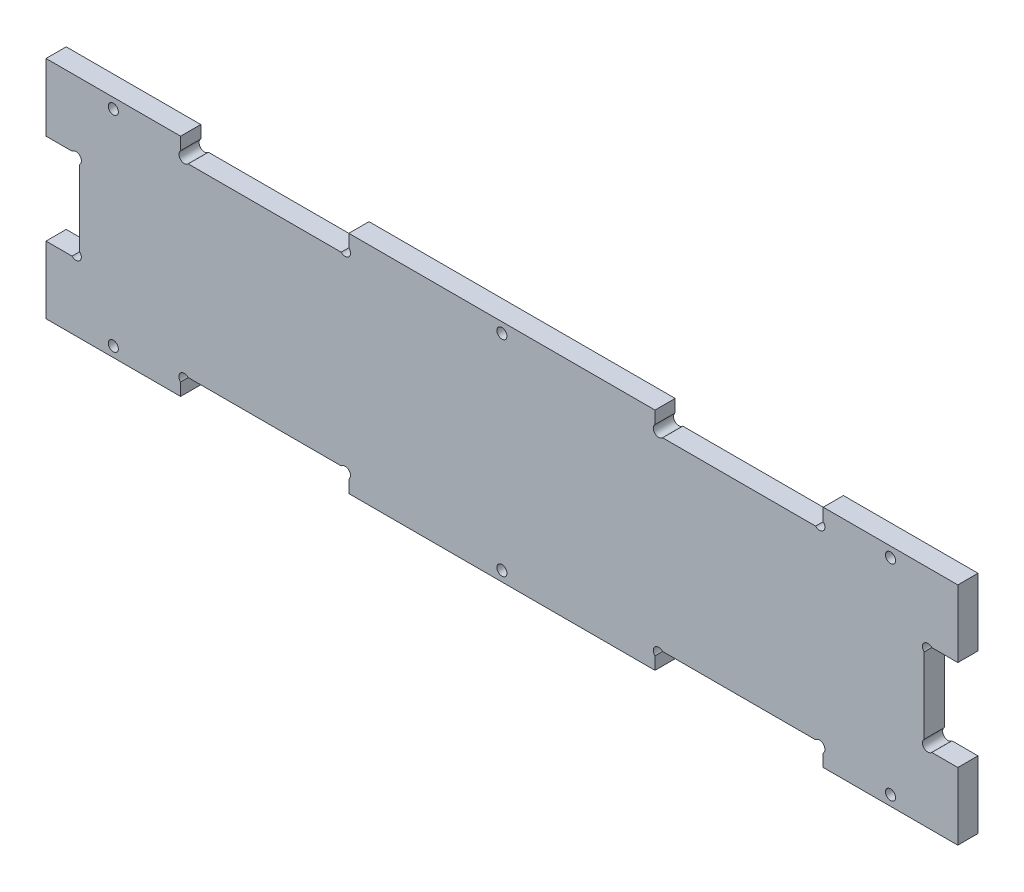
from build123d import *

# Parameters (mm, degrees)
ESQUISSE1_W             = 271
ESQUISSE1_H             = 55
BASE_EXTRUSION_DEPTH    = 6
ESQUISSE4_W             = 40
ESQUISSE4_H             = 6
ESQUISSE4_W_2           = 91
EXTRUSION1_DEPTH        = 6
ESQUISSE6_W             = 40
ESQUISSE6_H             = 6
ESQUISSE6_W_2           = 91
EXTRUSION2_DEPTH        = 6
ESQUISSE2_R             = 1.5
ENL_V_MAT_EXTRU_3_DEPTH = 6
ESQUISSE7_W             = 10
ESQUISSE7_H             = 27
ENL_V_MAT_EXTRU_4_DEPTH = 6
ESQUISSE5_R             = 1.6
ENL_V_MAT_EXTRU_2_DEPTH = 6


with BuildPart() as part:
    # Esquisse1 → Base-Extrusion (new body)
    with BuildSketch(Plane.XY):
        with Locations((85.838267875, 9.500100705)):
            Rectangle(ESQUISSE1_W, ESQUISSE1_H)
    extrude(amount=BASE_EXTRUSION_DEPTH)

    # Esquisse4 → Extrusion1 (add)
    with BuildSketch(Plane.XZ.offset(17.999899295)):
        with Locations((201.338267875, 3)):
            Rectangle(ESQUISSE4_W, ESQUISSE4_H)
        with Locations((-29.661732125, 3)):
            Rectangle(ESQUISSE4_W, ESQUISSE4_H)
        with Locations((85.838267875, 3)):
            Rectangle(ESQUISSE4_W_2, ESQUISSE4_H)
    extrude(amount=EXTRUSION1_DEPTH)

    # Esquisse6 → Extrusion2 (add)
    with BuildSketch(Plane(origin=(0, 37.000100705, 0), x_dir=(-1, 0, 0), z_dir=(0, 1, 0))):
        with Locations((29.661732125, 3)):
            Rectangle(ESQUISSE6_W, ESQUISSE6_H)
        with Locations((-85.838267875, 3)):
            Rectangle(ESQUISSE6_W_2, ESQUISSE6_H)
        with Locations((-201.338267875, 3)):
            Rectangle(ESQUISSE6_W, ESQUISSE6_H)
    extrude(amount=EXTRUSION2_DEPTH)

    # Esquisse2 → Enl_v. mat.-Extru.3 (cut)
    with BuildSketch(Plane.XY.offset(6)):
        with Locations((201.338267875, -20.999899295)):
            Circle(ESQUISSE2_R)
        with Locations((85.838267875, -20.999899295)):
            Circle(ESQUISSE2_R)
        with Locations((-29.661732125, -20.999899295)):
            Circle(ESQUISSE2_R)
        with Locations((-29.661732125, 40.000100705)):
            Circle(ESQUISSE2_R)
        with Locations((85.838267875, 40.000100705)):
            Circle(ESQUISSE2_R)
        with Locations((201.338267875, 40.000100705)):
            Circle(ESQUISSE2_R)
    extrude(amount=-ENL_V_MAT_EXTRU_3_DEPTH, mode=Mode.SUBTRACT)

    # Esquisse7 → Enl_v. mat.-Extru.4 (cut)
    with BuildSketch(Plane.XY.offset(6)):
        with Locations((216.338267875, 9.500100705)):
            Rectangle(ESQUISSE7_W, ESQUISSE7_H)
        with Locations((-44.661732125, 9.500100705)):
            Rectangle(ESQUISSE7_W, ESQUISSE7_H)
    extrude(amount=-ENL_V_MAT_EXTRU_4_DEPTH, mode=Mode.SUBTRACT)

    # Esquisse5 → Enl_v. mat.-Extru.2 (cut)
    with BuildSketch(Plane.XY.offset(6)):
        with Locations((39.238267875, -19.099899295)):
            Circle(ESQUISSE5_R)
        with Locations((-8.561732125, -19.099899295)):
            Circle(ESQUISSE5_R)
        with Locations((180.238267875, -19.099899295)):
            Circle(ESQUISSE5_R)
        with Locations((132.438267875, -19.099899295)):
            Circle(ESQUISSE5_R)
        with Locations((132.438267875, 38.100100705)):
            Circle(ESQUISSE5_R)
        with Locations((180.238267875, 38.100100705)):
            Circle(ESQUISSE5_R)
        with Locations((-8.561732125, 38.100100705)):
            Circle(ESQUISSE5_R)
        with Locations((39.238267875, 38.100100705)):
            Circle(ESQUISSE5_R)
        with Locations((212.438267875, -2.899899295)):
            Circle(ESQUISSE5_R)
        with Locations((212.438267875, 21.900100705)):
            Circle(ESQUISSE5_R)
        with Locations((-40.761732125, -2.899899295)):
            Circle(ESQUISSE5_R)
        with Locations((-40.761732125, 21.900100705)):
            Circle(ESQUISSE5_R)
    extrude(amount=-ENL_V_MAT_EXTRU_2_DEPTH, mode=Mode.SUBTRACT)


solid = part.part
